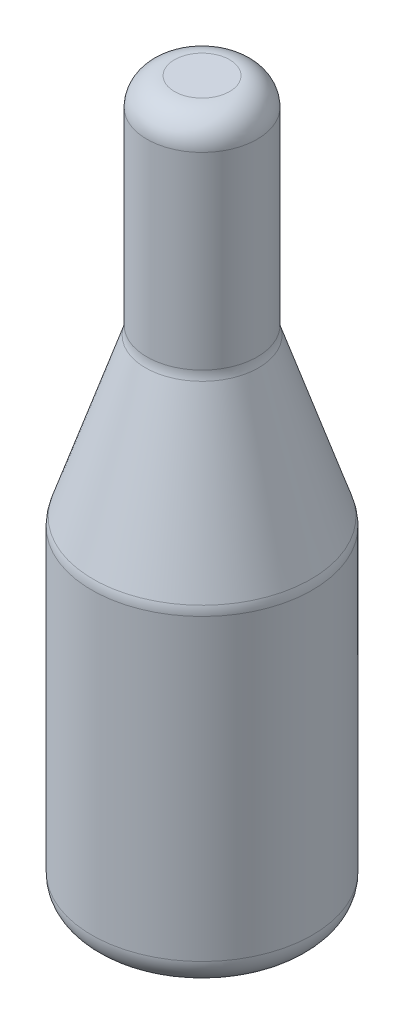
from build123d import *


with BuildPart() as part:
    # Sketch3 → Revolve3 (revolve)
    with BuildSketch(Plane.XY, mode=Mode.PRIVATE) as revolve3_sk:
        with BuildLine():
            Line((0, 0), (150, 0))
            ThreePointArc((150, 0), (185.355339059, 14.644660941), (200, 50))
            Line((200, 50), (200, 591.886116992))
            ThreePointArc((200, 591.886116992), (199.354372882, 599.895229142), (197.434164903, 607.697505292))
            Line((197.434164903, 607.697505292), (102.565835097, 892.302494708))
            ThreePointArc((102.565835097, 892.302494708), (100.645627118, 900.104770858), (100, 908.113883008))
            Line((100, 908.113883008), (100, 1250))
            ThreePointArc((100, 1250), (85.355339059, 1285.355339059), (50, 1300))
            Line((50, 1300), (0, 1300))
            Line((0, 1300), (0, 0))
        make_face()
    revolve(revolve3_sk.sketch.rotate(Axis((0, 0, 0), (0, 1, 0)), 90), axis=Axis((0, 0, 0), (0, 1, 0)))


solid = part.part
